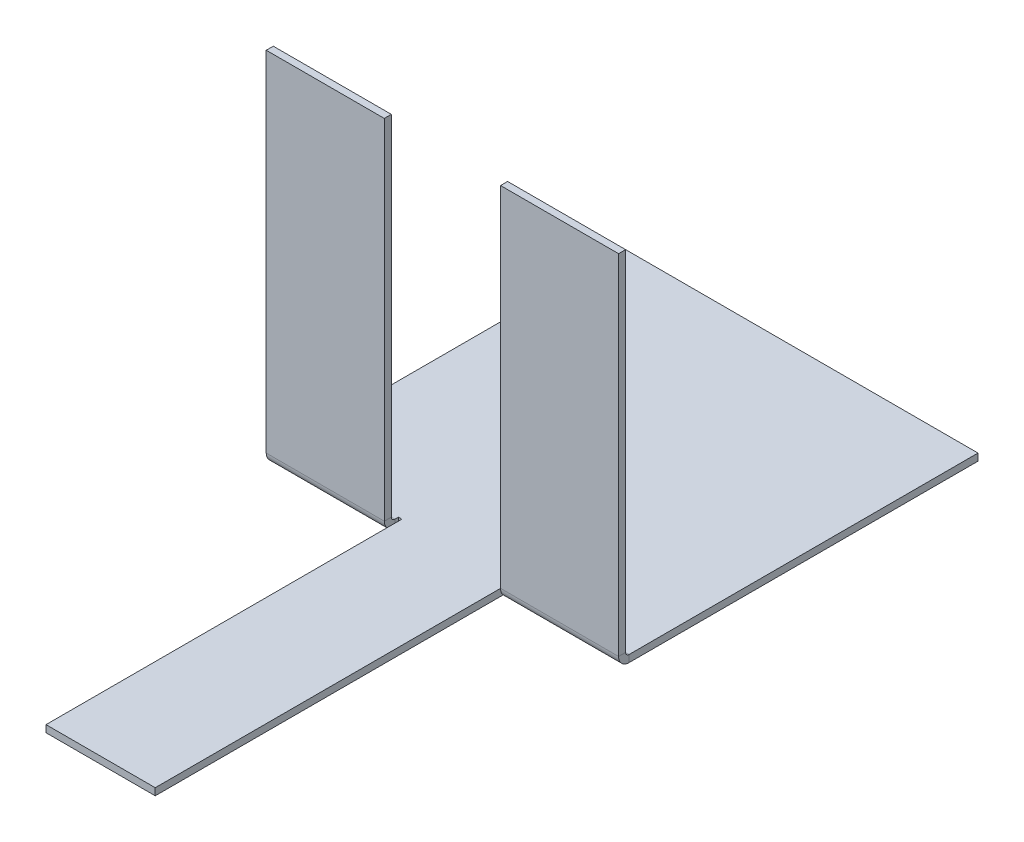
ISO-10303-21;
HEADER;
FILE_DESCRIPTION(('STEP AP214'),'2;1');
FILE_NAME('part.step','',(''),(''),'','','');
FILE_SCHEMA(('AUTOMOTIVE_DESIGN { 1 0 10303 214 1 1 1 1 }'));
ENDSEC;
DATA;
#1=APPLICATION_CONTEXT('core data for automotive mechanical design processes');
#2=APPLICATION_PROTOCOL_DEFINITION('international standard','automotive_design',2000,#1);
#3=PRODUCT_CONTEXT('',#1,'mechanical');
#4=PRODUCT('Part','Part','',(#3));
#5=PRODUCT_RELATED_PRODUCT_CATEGORY('part','',(#4));
#6=PRODUCT_DEFINITION_FORMATION('','',#4);
#7=PRODUCT_DEFINITION_CONTEXT('part definition',#1,'design');
#8=PRODUCT_DEFINITION('design','',#6,#7);
#9=PRODUCT_DEFINITION_SHAPE('','',#8);
#10=(LENGTH_UNIT() NAMED_UNIT(*) SI_UNIT(.MILLI.,.METRE.));
#11=(NAMED_UNIT(*) PLANE_ANGLE_UNIT() SI_UNIT($,.RADIAN.));
#12=(NAMED_UNIT(*) SI_UNIT($,.STERADIAN.) SOLID_ANGLE_UNIT());
#13=UNCERTAINTY_MEASURE_WITH_UNIT(LENGTH_MEASURE(1.E-05),#10,'distance_accuracy_value','');
#14=(GEOMETRIC_REPRESENTATION_CONTEXT(3) GLOBAL_UNCERTAINTY_ASSIGNED_CONTEXT((#13)) GLOBAL_UNIT_ASSIGNED_CONTEXT((#10,
#11,#12)) REPRESENTATION_CONTEXT('',''));
#15=CARTESIAN_POINT('',(0.,0.,0.));
#16=DIRECTION('',(0.,0.,1.));
#17=DIRECTION('',(1.,0.,0.));
#18=AXIS2_PLACEMENT_3D('',#15,#16,#17);
#19=CARTESIAN_POINT('',(0.,-2.,100.));
#20=DIRECTION('',(0.,1.,0.));
#21=DIRECTION('',(0.,0.,1.));
#22=AXIS2_PLACEMENT_3D('',#19,#20,#21);
#23=PLANE('',#22);
#24=DIRECTION('',(1.,0.,0.));
#25=VECTOR('',#24,1.);
#26=CARTESIAN_POINT('',(100.,-2.,99.));
#27=LINE('',#26,#25);
#28=CARTESIAN_POINT('',(100.,-2.,99.));
#29=VERTEX_POINT('',#28);
#30=CARTESIAN_POINT('',(66.5,-2.,99.));
#31=VERTEX_POINT('',#30);
#32=EDGE_CURVE('E227',#29,#31,#27,.F.);
#33=ORIENTED_EDGE('',*,*,#32,.T.);
#34=DIRECTION('',(0.,0.,1.));
#35=VECTOR('',#34,1.);
#36=CARTESIAN_POINT('',(66.5,-2.,100.));
#37=LINE('',#36,#35);
#38=CARTESIAN_POINT('',(66.5,-2.,98.));
#39=VERTEX_POINT('',#38);
#40=EDGE_CURVE('E176',#39,#31,#37,.T.);
#41=ORIENTED_EDGE('',*,*,#40,.F.);
#42=DIRECTION('',(1.,0.,0.));
#43=VECTOR('',#42,1.);
#44=CARTESIAN_POINT('',(0.,-2.,98.));
#45=LINE('',#44,#43);
#46=CARTESIAN_POINT('',(65.5,-2.,98.));
#47=VERTEX_POINT('',#46);
#48=EDGE_CURVE('E173',#47,#39,#45,.T.);
#49=ORIENTED_EDGE('',*,*,#48,.F.);
#50=DIRECTION('',(0.,0.,-1.));
#51=VECTOR('',#50,1.);
#52=CARTESIAN_POINT('',(65.5,-2.,100.));
#53=LINE('',#52,#51);
#54=CARTESIAN_POINT('',(65.5,-2.,199.));
#55=VERTEX_POINT('',#54);
#56=EDGE_CURVE('E167',#55,#47,#53,.T.);
#57=ORIENTED_EDGE('',*,*,#56,.F.);
#58=DIRECTION('',(1.,0.,0.));
#59=VECTOR('',#58,1.);
#60=CARTESIAN_POINT('',(34.5,-2.,199.));
#61=LINE('',#60,#59);
#62=CARTESIAN_POINT('',(34.5,-2.,199.));
#63=VERTEX_POINT('',#62);
#64=EDGE_CURVE('E171',#63,#55,#61,.T.);
#65=ORIENTED_EDGE('',*,*,#64,.F.);
#66=DIRECTION('',(0.,0.,1.));
#67=VECTOR('',#66,1.);
#68=CARTESIAN_POINT('',(34.5,-2.,100.));
#69=LINE('',#68,#67);
#70=CARTESIAN_POINT('',(34.5,-2.,98.));
#71=VERTEX_POINT('',#70);
#72=EDGE_CURVE('E49',#71,#63,#69,.T.);
#73=ORIENTED_EDGE('',*,*,#72,.F.);
#74=DIRECTION('',(1.,0.,0.));
#75=VECTOR('',#74,1.);
#76=CARTESIAN_POINT('',(0.,-2.,98.));
#77=LINE('',#76,#75);
#78=CARTESIAN_POINT('',(33.5,-2.,98.));
#79=VERTEX_POINT('',#78);
#80=EDGE_CURVE('E53',#79,#71,#77,.T.);
#81=ORIENTED_EDGE('',*,*,#80,.F.);
#82=DIRECTION('',(0.,0.,-1.));
#83=VECTOR('',#82,1.);
#84=CARTESIAN_POINT('',(33.5,-2.,100.));
#85=LINE('',#84,#83);
#86=CARTESIAN_POINT('',(33.5,-2.,99.));
#87=VERTEX_POINT('',#86);
#88=EDGE_CURVE('E319',#87,#79,#85,.T.);
#89=ORIENTED_EDGE('',*,*,#88,.F.);
#90=DIRECTION('',(1.,0.,0.));
#91=VECTOR('',#90,1.);
#92=CARTESIAN_POINT('',(33.5,-2.,99.));
#93=LINE('',#92,#91);
#94=CARTESIAN_POINT('',(0.,-2.,99.));
#95=VERTEX_POINT('',#94);
#96=EDGE_CURVE('E294',#87,#95,#93,.F.);
#97=ORIENTED_EDGE('',*,*,#96,.T.);
#98=DIRECTION('',(0.,0.,-1.));
#99=VECTOR('',#98,1.);
#100=CARTESIAN_POINT('',(0.,-2.,100.));
#101=LINE('',#100,#99);
#102=CARTESIAN_POINT('',(0.,-2.,0.));
#103=VERTEX_POINT('',#102);
#104=EDGE_CURVE('E346',#95,#103,#101,.T.);
#105=ORIENTED_EDGE('',*,*,#104,.T.);
#106=DIRECTION('',(1.,0.,0.));
#107=VECTOR('',#106,1.);
#108=CARTESIAN_POINT('',(0.,-2.,0.));
#109=LINE('',#108,#107);
#110=CARTESIAN_POINT('',(100.,-2.,0.));
#111=VERTEX_POINT('',#110);
#112=EDGE_CURVE('E334',#103,#111,#109,.T.);
#113=ORIENTED_EDGE('',*,*,#112,.T.);
#114=DIRECTION('',(0.,0.,-1.));
#115=VECTOR('',#114,1.);
#116=CARTESIAN_POINT('',(100.,-2.,100.));
#117=LINE('',#116,#115);
#118=EDGE_CURVE('E11',#29,#111,#117,.T.);
#119=ORIENTED_EDGE('',*,*,#118,.F.);
#120=EDGE_LOOP('',(#33,#41,#49,#57,#65,#73,#81,#89,#97,#105,#113,#119));
#121=FACE_BOUND('',#120,.T.);
#122=ADVANCED_FACE('F35',(#121),#23,.F.);
#123=CARTESIAN_POINT('',(0.,0.,100.));
#124=DIRECTION('',(0.,1.,0.));
#125=DIRECTION('',(0.,0.,1.));
#126=AXIS2_PLACEMENT_3D('',#123,#124,#125);
#127=PLANE('',#126);
#128=DIRECTION('',(0.,0.,-1.));
#129=VECTOR('',#128,1.);
#130=CARTESIAN_POINT('',(66.5,0.,99.));
#131=LINE('',#130,#129);
#132=CARTESIAN_POINT('',(66.5,0.,99.));
#133=VERTEX_POINT('',#132);
#134=CARTESIAN_POINT('',(66.5,0.,98.));
#135=VERTEX_POINT('',#134);
#136=EDGE_CURVE('E250',#133,#135,#131,.T.);
#137=ORIENTED_EDGE('',*,*,#136,.F.);
#138=DIRECTION('',(1.,0.,0.));
#139=VECTOR('',#138,1.);
#140=CARTESIAN_POINT('',(100.,0.,99.));
#141=LINE('',#140,#139);
#142=CARTESIAN_POINT('',(100.,0.,99.));
#143=VERTEX_POINT('',#142);
#144=EDGE_CURVE('E239',#143,#133,#141,.F.);
#145=ORIENTED_EDGE('',*,*,#144,.F.);
#146=DIRECTION('',(0.,0.,-1.));
#147=VECTOR('',#146,1.);
#148=CARTESIAN_POINT('',(100.,0.,100.));
#149=LINE('',#148,#147);
#150=CARTESIAN_POINT('',(100.,0.,0.));
#151=VERTEX_POINT('',#150);
#152=EDGE_CURVE('E42',#143,#151,#149,.T.);
#153=ORIENTED_EDGE('',*,*,#152,.T.);
#154=DIRECTION('',(1.,0.,0.));
#155=VECTOR('',#154,1.);
#156=CARTESIAN_POINT('',(0.,0.,0.));
#157=LINE('',#156,#155);
#158=CARTESIAN_POINT('',(0.,0.,0.));
#159=VERTEX_POINT('',#158);
#160=EDGE_CURVE('E340',#159,#151,#157,.T.);
#161=ORIENTED_EDGE('',*,*,#160,.F.);
#162=DIRECTION('',(0.,0.,-1.));
#163=VECTOR('',#162,1.);
#164=CARTESIAN_POINT('',(0.,0.,100.));
#165=LINE('',#164,#163);
#166=CARTESIAN_POINT('',(0.,0.,99.));
#167=VERTEX_POINT('',#166);
#168=EDGE_CURVE('E348',#167,#159,#165,.T.);
#169=ORIENTED_EDGE('',*,*,#168,.F.);
#170=DIRECTION('',(1.,0.,0.));
#171=VECTOR('',#170,1.);
#172=CARTESIAN_POINT('',(33.5,0.,99.));
#173=LINE('',#172,#171);
#174=CARTESIAN_POINT('',(33.5,0.,99.));
#175=VERTEX_POINT('',#174);
#176=EDGE_CURVE('E306',#175,#167,#173,.F.);
#177=ORIENTED_EDGE('',*,*,#176,.F.);
#178=DIRECTION('',(0.,0.,1.));
#179=VECTOR('',#178,1.);
#180=CARTESIAN_POINT('',(33.5,0.,98.));
#181=LINE('',#180,#179);
#182=CARTESIAN_POINT('',(33.5,0.,98.));
#183=VERTEX_POINT('',#182);
#184=EDGE_CURVE('E324',#183,#175,#181,.T.);
#185=ORIENTED_EDGE('',*,*,#184,.F.);
#186=DIRECTION('',(-1.,0.,0.));
#187=VECTOR('',#186,1.);
#188=CARTESIAN_POINT('',(34.5,0.,98.));
#189=LINE('',#188,#187);
#190=CARTESIAN_POINT('',(34.5,0.,98.));
#191=VERTEX_POINT('',#190);
#192=EDGE_CURVE('E320',#191,#183,#189,.T.);
#193=ORIENTED_EDGE('',*,*,#192,.F.);
#194=DIRECTION('',(0.,0.,-1.));
#195=VECTOR('',#194,1.);
#196=CARTESIAN_POINT('',(34.5,0.,100.));
#197=LINE('',#196,#195);
#198=CARTESIAN_POINT('',(34.5,0.,199.));
#199=VERTEX_POINT('',#198);
#200=EDGE_CURVE('E316',#199,#191,#197,.T.);
#201=ORIENTED_EDGE('',*,*,#200,.F.);
#202=DIRECTION('',(-1.,0.,0.));
#203=VECTOR('',#202,1.);
#204=CARTESIAN_POINT('',(65.5,0.,199.));
#205=LINE('',#204,#203);
#206=CARTESIAN_POINT('',(65.5,0.,199.));
#207=VERTEX_POINT('',#206);
#208=EDGE_CURVE('E186',#207,#199,#205,.T.);
#209=ORIENTED_EDGE('',*,*,#208,.F.);
#210=DIRECTION('',(0.,0.,1.));
#211=VECTOR('',#210,1.);
#212=CARTESIAN_POINT('',(65.5,0.,98.));
#213=LINE('',#212,#211);
#214=CARTESIAN_POINT('',(65.5,0.,98.));
#215=VERTEX_POINT('',#214);
#216=EDGE_CURVE('E182',#215,#207,#213,.T.);
#217=ORIENTED_EDGE('',*,*,#216,.F.);
#218=DIRECTION('',(-1.,0.,0.));
#219=VECTOR('',#218,1.);
#220=CARTESIAN_POINT('',(66.5,0.,98.));
#221=LINE('',#220,#219);
#222=EDGE_CURVE('E253',#135,#215,#221,.T.);
#223=ORIENTED_EDGE('',*,*,#222,.F.);
#224=EDGE_LOOP('',(#137,#145,#153,#161,#169,#177,#185,#193,#201,#209,#217,#223));
#225=FACE_BOUND('',#224,.T.);
#226=ADVANCED_FACE('F354',(#225),#127,.T.);
#227=CARTESIAN_POINT('',(100.,0.,100.));
#228=DIRECTION('',(1.,0.,0.));
#229=DIRECTION('',(0.,0.,-1.));
#230=AXIS2_PLACEMENT_3D('',#227,#228,#229);
#231=PLANE('',#230);
#232=ORIENTED_EDGE('',*,*,#152,.F.);
#233=DIRECTION('',(0.,-1.,0.));
#234=VECTOR('',#233,1.);
#235=CARTESIAN_POINT('',(100.,0.,99.));
#236=LINE('',#235,#234);
#237=EDGE_CURVE('E233',#143,#29,#236,.T.);
#238=ORIENTED_EDGE('',*,*,#237,.T.);
#239=ORIENTED_EDGE('',*,*,#118,.T.);
#240=DIRECTION('',(0.,-1.,0.));
#241=VECTOR('',#240,1.);
#242=CARTESIAN_POINT('',(100.,0.,0.));
#243=LINE('',#242,#241);
#244=EDGE_CURVE('E337',#151,#111,#243,.T.);
#245=ORIENTED_EDGE('',*,*,#244,.F.);
#246=EDGE_LOOP('',(#232,#238,#239,#245));
#247=FACE_BOUND('',#246,.T.);
#248=ADVANCED_FACE('F358',(#247),#231,.T.);
#249=CARTESIAN_POINT('',(0.,-2.,100.));
#250=DIRECTION('',(-1.,0.,0.));
#251=DIRECTION('',(0.,0.,1.));
#252=AXIS2_PLACEMENT_3D('',#249,#250,#251);
#253=PLANE('',#252);
#254=DIRECTION('',(0.,-1.,0.));
#255=VECTOR('',#254,1.);
#256=CARTESIAN_POINT('',(0.,0.,99.));
#257=LINE('',#256,#255);
#258=EDGE_CURVE('E311',#167,#95,#257,.T.);
#259=ORIENTED_EDGE('',*,*,#258,.F.);
#260=ORIENTED_EDGE('',*,*,#168,.T.);
#261=DIRECTION('',(0.,1.,0.));
#262=VECTOR('',#261,1.);
#263=CARTESIAN_POINT('',(0.,-2.,0.));
#264=LINE('',#263,#262);
#265=EDGE_CURVE('E343',#103,#159,#264,.T.);
#266=ORIENTED_EDGE('',*,*,#265,.F.);
#267=ORIENTED_EDGE('',*,*,#104,.F.);
#268=EDGE_LOOP('',(#259,#260,#266,#267));
#269=FACE_BOUND('',#268,.T.);
#270=ADVANCED_FACE('F365',(#269),#253,.T.);
#271=CARTESIAN_POINT('',(100.,-2.,0.));
#272=DIRECTION('',(0.,0.,-1.));
#273=DIRECTION('',(-1.,0.,0.));
#274=AXIS2_PLACEMENT_3D('',#271,#272,#273);
#275=PLANE('',#274);
#276=ORIENTED_EDGE('',*,*,#112,.F.);
#277=ORIENTED_EDGE('',*,*,#265,.T.);
#278=ORIENTED_EDGE('',*,*,#160,.T.);
#279=ORIENTED_EDGE('',*,*,#244,.T.);
#280=EDGE_LOOP('',(#276,#277,#278,#279));
#281=FACE_BOUND('',#280,.T.);
#282=ADVANCED_FACE('F361',(#281),#275,.T.);
#283=CARTESIAN_POINT('',(34.5,0.,98.));
#284=DIRECTION('',(0.,0.,1.));
#285=DIRECTION('',(0.,-1.,0.));
#286=AXIS2_PLACEMENT_3D('',#283,#284,#285);
#287=PLANE('',#286);
#288=DIRECTION('',(0.,-1.,0.));
#289=VECTOR('',#288,1.);
#290=CARTESIAN_POINT('',(33.5,0.,98.));
#291=LINE('',#290,#289);
#292=EDGE_CURVE('E314',#183,#79,#291,.T.);
#293=ORIENTED_EDGE('',*,*,#292,.T.);
#294=ORIENTED_EDGE('',*,*,#80,.T.);
#295=DIRECTION('',(0.,-1.,0.));
#296=VECTOR('',#295,1.);
#297=CARTESIAN_POINT('',(34.5,0.,98.));
#298=LINE('',#297,#296);
#299=EDGE_CURVE('E323',#191,#71,#298,.T.);
#300=ORIENTED_EDGE('',*,*,#299,.F.);
#301=ORIENTED_EDGE('',*,*,#192,.T.);
#302=EDGE_LOOP('',(#293,#294,#300,#301));
#303=FACE_BOUND('',#302,.T.);
#304=ADVANCED_FACE('F421',(#303),#287,.T.);
#305=CARTESIAN_POINT('',(34.5,0.,100.));
#306=DIRECTION('',(-1.,0.,0.));
#307=DIRECTION('',(0.,0.,1.));
#308=AXIS2_PLACEMENT_3D('',#305,#306,#307);
#309=PLANE('',#308);
#310=ORIENTED_EDGE('',*,*,#299,.T.);
#311=ORIENTED_EDGE('',*,*,#72,.T.);
#312=DIRECTION('',(0.,-1.,0.));
#313=VECTOR('',#312,1.);
#314=CARTESIAN_POINT('',(34.5,0.,199.));
#315=LINE('',#314,#313);
#316=EDGE_CURVE('E191',#199,#63,#315,.T.);
#317=ORIENTED_EDGE('',*,*,#316,.F.);
#318=ORIENTED_EDGE('',*,*,#200,.T.);
#319=EDGE_LOOP('',(#310,#311,#317,#318));
#320=FACE_BOUND('',#319,.T.);
#321=ADVANCED_FACE('F422',(#320),#309,.T.);
#322=CARTESIAN_POINT('',(33.5,0.,98.));
#323=DIRECTION('',(1.,0.,0.));
#324=DIRECTION('',(0.,0.,-1.));
#325=AXIS2_PLACEMENT_3D('',#322,#323,#324);
#326=PLANE('',#325);
#327=DIRECTION('',(0.,-1.,0.));
#328=VECTOR('',#327,1.);
#329=CARTESIAN_POINT('',(33.5,0.,99.));
#330=LINE('',#329,#328);
#331=EDGE_CURVE('E300',#175,#87,#330,.T.);
#332=ORIENTED_EDGE('',*,*,#331,.T.);
#333=ORIENTED_EDGE('',*,*,#88,.T.);
#334=ORIENTED_EDGE('',*,*,#292,.F.);
#335=ORIENTED_EDGE('',*,*,#184,.T.);
#336=EDGE_LOOP('',(#332,#333,#334,#335));
#337=FACE_BOUND('',#336,.T.);
#338=ADVANCED_FACE('F425',(#337),#326,.T.);
#339=CARTESIAN_POINT('',(0.,1.,99.));
#340=DIRECTION('',(-1.,0.,0.));
#341=DIRECTION('',(0.,0.,1.));
#342=AXIS2_PLACEMENT_3D('',#339,#340,#341);
#343=PLANE('',#342);
#344=DIRECTION('',(0.,0.,1.));
#345=VECTOR('',#344,1.);
#346=CARTESIAN_POINT('',(0.,1.,100.));
#347=LINE('',#346,#345);
#348=CARTESIAN_POINT('',(0.,1.,100.));
#349=VERTEX_POINT('',#348);
#350=CARTESIAN_POINT('',(0.,1.,102.));
#351=VERTEX_POINT('',#350);
#352=EDGE_CURVE('E263',#349,#351,#347,.T.);
#353=ORIENTED_EDGE('',*,*,#352,.F.);
#354=CARTESIAN_POINT('',(0.,1.,99.));
#355=DIRECTION('',(1.,0.,0.));
#356=DIRECTION('',(0.,0.,-1.));
#357=AXIS2_PLACEMENT_3D('',#354,#355,#356);
#358=CIRCLE('',#357,1.);
#359=EDGE_CURVE('E303',#167,#349,#358,.F.);
#360=ORIENTED_EDGE('',*,*,#359,.F.);
#361=ORIENTED_EDGE('',*,*,#258,.T.);
#362=CARTESIAN_POINT('',(0.,1.,99.));
#363=DIRECTION('',(1.,0.,0.));
#364=DIRECTION('',(0.,0.,-1.));
#365=AXIS2_PLACEMENT_3D('',#362,#363,#364);
#366=CIRCLE('',#365,3.);
#367=EDGE_CURVE('E296',#95,#351,#366,.F.);
#368=ORIENTED_EDGE('',*,*,#367,.T.);
#369=EDGE_LOOP('',(#353,#360,#361,#368));
#370=FACE_BOUND('',#369,.T.);
#371=ADVANCED_FACE('F372',(#370),#343,.T.);
#372=CARTESIAN_POINT('',(33.5,1.,99.));
#373=DIRECTION('',(-1.,0.,0.));
#374=DIRECTION('',(0.,0.,1.));
#375=AXIS2_PLACEMENT_3D('',#372,#373,#374);
#376=PLANE('',#375);
#377=CARTESIAN_POINT('',(33.5,1.,99.));
#378=DIRECTION('',(1.,0.,0.));
#379=DIRECTION('',(0.,0.,-1.));
#380=AXIS2_PLACEMENT_3D('',#377,#378,#379);
#381=CIRCLE('',#380,1.);
#382=CARTESIAN_POINT('',(33.5,1.,100.));
#383=VERTEX_POINT('',#382);
#384=EDGE_CURVE('E293',#383,#175,#381,.T.);
#385=ORIENTED_EDGE('',*,*,#384,.F.);
#386=DIRECTION('',(0.,0.,1.));
#387=VECTOR('',#386,1.);
#388=CARTESIAN_POINT('',(33.5,1.,100.));
#389=LINE('',#388,#387);
#390=CARTESIAN_POINT('',(33.5,1.,102.));
#391=VERTEX_POINT('',#390);
#392=EDGE_CURVE('E266',#383,#391,#389,.T.);
#393=ORIENTED_EDGE('',*,*,#392,.T.);
#394=CARTESIAN_POINT('',(33.5,1.,99.));
#395=DIRECTION('',(1.,0.,0.));
#396=DIRECTION('',(0.,0.,-1.));
#397=AXIS2_PLACEMENT_3D('',#394,#395,#396);
#398=CIRCLE('',#397,3.);
#399=EDGE_CURVE('E297',#391,#87,#398,.T.);
#400=ORIENTED_EDGE('',*,*,#399,.T.);
#401=ORIENTED_EDGE('',*,*,#331,.F.);
#402=EDGE_LOOP('',(#385,#393,#400,#401));
#403=FACE_BOUND('',#402,.T.);
#404=ADVANCED_FACE('F394',(#403),#376,.F.);
#405=CARTESIAN_POINT('',(33.5,1.,99.));
#406=DIRECTION('',(1.,0.,0.));
#407=DIRECTION('',(0.,0.,1.));
#408=AXIS2_PLACEMENT_3D('',#405,#406,#407);
#409=CYLINDRICAL_SURFACE('',#408,3.);
#410=ORIENTED_EDGE('',*,*,#96,.F.);
#411=ORIENTED_EDGE('',*,*,#399,.F.);
#412=DIRECTION('',(-1.,0.,0.));
#413=VECTOR('',#412,1.);
#414=CARTESIAN_POINT('',(33.5,1.,102.));
#415=LINE('',#414,#413);
#416=EDGE_CURVE('E269',#391,#351,#415,.T.);
#417=ORIENTED_EDGE('',*,*,#416,.T.);
#418=ORIENTED_EDGE('',*,*,#367,.F.);
#419=EDGE_LOOP('',(#410,#411,#417,#418));
#420=FACE_BOUND('',#419,.T.);
#421=ADVANCED_FACE('F404',(#420),#409,.T.);
#422=CARTESIAN_POINT('',(33.5,1.,99.));
#423=DIRECTION('',(1.,0.,0.));
#424=DIRECTION('',(0.,0.,1.));
#425=AXIS2_PLACEMENT_3D('',#422,#423,#424);
#426=CYLINDRICAL_SURFACE('',#425,1.);
#427=ORIENTED_EDGE('',*,*,#176,.T.);
#428=ORIENTED_EDGE('',*,*,#359,.T.);
#429=DIRECTION('',(1.,0.,0.));
#430=VECTOR('',#429,1.);
#431=CARTESIAN_POINT('',(0.,1.,100.));
#432=LINE('',#431,#430);
#433=EDGE_CURVE('E264',#349,#383,#432,.T.);
#434=ORIENTED_EDGE('',*,*,#433,.T.);
#435=ORIENTED_EDGE('',*,*,#384,.T.);
#436=EDGE_LOOP('',(#427,#428,#434,#435));
#437=FACE_BOUND('',#436,.T.);
#438=ADVANCED_FACE('F368',(#437),#426,.F.);
#439=CARTESIAN_POINT('',(33.5,100.,102.));
#440=DIRECTION('',(-1.,0.,0.));
#441=DIRECTION('',(0.,0.,1.));
#442=AXIS2_PLACEMENT_3D('',#439,#440,#441);
#443=PLANE('',#442);
#444=ORIENTED_EDGE('',*,*,#392,.F.);
#445=DIRECTION('',(0.,1.,0.));
#446=VECTOR('',#445,1.);
#447=CARTESIAN_POINT('',(33.5,100.,100.));
#448=LINE('',#447,#446);
#449=CARTESIAN_POINT('',(33.5,100.,100.));
#450=VERTEX_POINT('',#449);
#451=EDGE_CURVE('E273',#383,#450,#448,.T.);
#452=ORIENTED_EDGE('',*,*,#451,.T.);
#453=DIRECTION('',(0.,0.,-1.));
#454=VECTOR('',#453,1.);
#455=CARTESIAN_POINT('',(33.5,100.,102.));
#456=LINE('',#455,#454);
#457=CARTESIAN_POINT('',(33.5,100.,102.));
#458=VERTEX_POINT('',#457);
#459=EDGE_CURVE('E290',#458,#450,#456,.T.);
#460=ORIENTED_EDGE('',*,*,#459,.F.);
#461=DIRECTION('',(0.,1.,0.));
#462=VECTOR('',#461,1.);
#463=CARTESIAN_POINT('',(33.5,100.,102.));
#464=LINE('',#463,#462);
#465=EDGE_CURVE('E274',#391,#458,#464,.T.);
#466=ORIENTED_EDGE('',*,*,#465,.F.);
#467=EDGE_LOOP('',(#444,#452,#460,#466));
#468=FACE_BOUND('',#467,.T.);
#469=ADVANCED_FACE('F396',(#468),#443,.F.);
#470=CARTESIAN_POINT('',(0.,0.,102.));
#471=DIRECTION('',(1.,0.,0.));
#472=DIRECTION('',(0.,0.,-1.));
#473=AXIS2_PLACEMENT_3D('',#470,#471,#472);
#474=PLANE('',#473);
#475=ORIENTED_EDGE('',*,*,#352,.T.);
#476=DIRECTION('',(0.,-1.,0.));
#477=VECTOR('',#476,1.);
#478=CARTESIAN_POINT('',(0.,0.,102.));
#479=LINE('',#478,#477);
#480=CARTESIAN_POINT('',(0.,100.,102.));
#481=VERTEX_POINT('',#480);
#482=EDGE_CURVE('E279',#481,#351,#479,.T.);
#483=ORIENTED_EDGE('',*,*,#482,.F.);
#484=DIRECTION('',(0.,0.,-1.));
#485=VECTOR('',#484,1.);
#486=CARTESIAN_POINT('',(0.,100.,102.));
#487=LINE('',#486,#485);
#488=CARTESIAN_POINT('',(0.,100.,100.));
#489=VERTEX_POINT('',#488);
#490=EDGE_CURVE('E282',#481,#489,#487,.T.);
#491=ORIENTED_EDGE('',*,*,#490,.T.);
#492=DIRECTION('',(0.,-1.,0.));
#493=VECTOR('',#492,1.);
#494=CARTESIAN_POINT('',(0.,0.,100.));
#495=LINE('',#494,#493);
#496=EDGE_CURVE('E277',#489,#349,#495,.T.);
#497=ORIENTED_EDGE('',*,*,#496,.T.);
#498=EDGE_LOOP('',(#475,#483,#491,#497));
#499=FACE_BOUND('',#498,.T.);
#500=ADVANCED_FACE('F376',(#499),#474,.F.);
#501=CARTESIAN_POINT('',(33.5,0.,102.));
#502=DIRECTION('',(0.,0.,-1.));
#503=DIRECTION('',(-1.,0.,0.));
#504=AXIS2_PLACEMENT_3D('',#501,#502,#503);
#505=PLANE('',#504);
#506=ORIENTED_EDGE('',*,*,#416,.F.);
#507=ORIENTED_EDGE('',*,*,#465,.T.);
#508=DIRECTION('',(-1.,0.,0.));
#509=VECTOR('',#508,1.);
#510=CARTESIAN_POINT('',(0.,100.,102.));
#511=LINE('',#510,#509);
#512=EDGE_CURVE('E276',#458,#481,#511,.T.);
#513=ORIENTED_EDGE('',*,*,#512,.T.);
#514=ORIENTED_EDGE('',*,*,#482,.T.);
#515=EDGE_LOOP('',(#506,#507,#513,#514));
#516=FACE_BOUND('',#515,.T.);
#517=ADVANCED_FACE('F380',(#516),#505,.F.);
#518=CARTESIAN_POINT('',(33.5,0.,100.));
#519=DIRECTION('',(0.,0.,-1.));
#520=DIRECTION('',(-1.,0.,0.));
#521=AXIS2_PLACEMENT_3D('',#518,#519,#520);
#522=PLANE('',#521);
#523=ORIENTED_EDGE('',*,*,#451,.F.);
#524=ORIENTED_EDGE('',*,*,#433,.F.);
#525=ORIENTED_EDGE('',*,*,#496,.F.);
#526=DIRECTION('',(-1.,0.,0.));
#527=VECTOR('',#526,1.);
#528=CARTESIAN_POINT('',(0.,100.,100.));
#529=LINE('',#528,#527);
#530=EDGE_CURVE('E284',#450,#489,#529,.T.);
#531=ORIENTED_EDGE('',*,*,#530,.F.);
#532=EDGE_LOOP('',(#523,#524,#525,#531));
#533=FACE_BOUND('',#532,.T.);
#534=ADVANCED_FACE('F390',(#533),#522,.T.);
#535=CARTESIAN_POINT('',(0.,100.,102.));
#536=DIRECTION('',(0.,-1.,0.));
#537=DIRECTION('',(0.,0.,-1.));
#538=AXIS2_PLACEMENT_3D('',#535,#536,#537);
#539=PLANE('',#538);
#540=ORIENTED_EDGE('',*,*,#530,.T.);
#541=ORIENTED_EDGE('',*,*,#490,.F.);
#542=ORIENTED_EDGE('',*,*,#512,.F.);
#543=ORIENTED_EDGE('',*,*,#459,.T.);
#544=EDGE_LOOP('',(#540,#541,#542,#543));
#545=FACE_BOUND('',#544,.T.);
#546=ADVANCED_FACE('F386',(#545),#539,.F.);
#547=CARTESIAN_POINT('',(66.5,0.,98.));
#548=DIRECTION('',(0.,0.,1.));
#549=DIRECTION('',(0.,-1.,0.));
#550=AXIS2_PLACEMENT_3D('',#547,#548,#549);
#551=PLANE('',#550);
#552=DIRECTION('',(0.,-1.,0.));
#553=VECTOR('',#552,1.);
#554=CARTESIAN_POINT('',(65.5,0.,98.));
#555=LINE('',#554,#553);
#556=EDGE_CURVE('E247',#215,#47,#555,.T.);
#557=ORIENTED_EDGE('',*,*,#556,.T.);
#558=ORIENTED_EDGE('',*,*,#48,.T.);
#559=DIRECTION('',(0.,-1.,0.));
#560=VECTOR('',#559,1.);
#561=CARTESIAN_POINT('',(66.5,0.,98.));
#562=LINE('',#561,#560);
#563=EDGE_CURVE('E256',#135,#39,#562,.T.);
#564=ORIENTED_EDGE('',*,*,#563,.F.);
#565=ORIENTED_EDGE('',*,*,#222,.T.);
#566=EDGE_LOOP('',(#557,#558,#564,#565));
#567=FACE_BOUND('',#566,.T.);
#568=ADVANCED_FACE('F445',(#567),#551,.T.);
#569=CARTESIAN_POINT('',(65.5,0.,98.));
#570=DIRECTION('',(1.,0.,0.));
#571=DIRECTION('',(0.,0.,-1.));
#572=AXIS2_PLACEMENT_3D('',#569,#570,#571);
#573=PLANE('',#572);
#574=ORIENTED_EDGE('',*,*,#216,.T.);
#575=DIRECTION('',(0.,1.,0.));
#576=VECTOR('',#575,1.);
#577=CARTESIAN_POINT('',(65.5,-2.,199.));
#578=LINE('',#577,#576);
#579=EDGE_CURVE('E179',#55,#207,#578,.T.);
#580=ORIENTED_EDGE('',*,*,#579,.F.);
#581=ORIENTED_EDGE('',*,*,#56,.T.);
#582=ORIENTED_EDGE('',*,*,#556,.F.);
#583=EDGE_LOOP('',(#574,#580,#581,#582));
#584=FACE_BOUND('',#583,.T.);
#585=ADVANCED_FACE('F180',(#584),#573,.T.);
#586=CARTESIAN_POINT('',(66.5,0.,99.));
#587=DIRECTION('',(-1.,0.,0.));
#588=DIRECTION('',(0.,0.,1.));
#589=AXIS2_PLACEMENT_3D('',#586,#587,#588);
#590=PLANE('',#589);
#591=ORIENTED_EDGE('',*,*,#563,.T.);
#592=ORIENTED_EDGE('',*,*,#40,.T.);
#593=DIRECTION('',(0.,-1.,0.));
#594=VECTOR('',#593,1.);
#595=CARTESIAN_POINT('',(66.5,0.,99.));
#596=LINE('',#595,#594);
#597=EDGE_CURVE('E244',#133,#31,#596,.T.);
#598=ORIENTED_EDGE('',*,*,#597,.F.);
#599=ORIENTED_EDGE('',*,*,#136,.T.);
#600=EDGE_LOOP('',(#591,#592,#598,#599));
#601=FACE_BOUND('',#600,.T.);
#602=ADVANCED_FACE('F447',(#601),#590,.T.);
#603=CARTESIAN_POINT('',(66.5,1.,99.));
#604=DIRECTION('',(-1.,0.,0.));
#605=DIRECTION('',(0.,0.,1.));
#606=AXIS2_PLACEMENT_3D('',#603,#604,#605);
#607=PLANE('',#606);
#608=DIRECTION('',(0.,0.,1.));
#609=VECTOR('',#608,1.);
#610=CARTESIAN_POINT('',(66.5,1.,100.));
#611=LINE('',#610,#609);
#612=CARTESIAN_POINT('',(66.5,1.,100.));
#613=VERTEX_POINT('',#612);
#614=CARTESIAN_POINT('',(66.5,1.,102.));
#615=VERTEX_POINT('',#614);
#616=EDGE_CURVE('E196',#613,#615,#611,.T.);
#617=ORIENTED_EDGE('',*,*,#616,.F.);
#618=CARTESIAN_POINT('',(66.5,1.,99.));
#619=DIRECTION('',(1.,0.,0.));
#620=DIRECTION('',(0.,0.,-1.));
#621=AXIS2_PLACEMENT_3D('',#618,#619,#620);
#622=CIRCLE('',#621,1.);
#623=EDGE_CURVE('E236',#133,#613,#622,.F.);
#624=ORIENTED_EDGE('',*,*,#623,.F.);
#625=ORIENTED_EDGE('',*,*,#597,.T.);
#626=CARTESIAN_POINT('',(66.5,1.,99.));
#627=DIRECTION('',(1.,0.,0.));
#628=DIRECTION('',(0.,0.,-1.));
#629=AXIS2_PLACEMENT_3D('',#626,#627,#628);
#630=CIRCLE('',#629,3.);
#631=EDGE_CURVE('E229',#31,#615,#630,.F.);
#632=ORIENTED_EDGE('',*,*,#631,.T.);
#633=EDGE_LOOP('',(#617,#624,#625,#632));
#634=FACE_BOUND('',#633,.T.);
#635=ADVANCED_FACE('F451',(#634),#607,.T.);
#636=CARTESIAN_POINT('',(100.,1.,99.));
#637=DIRECTION('',(-1.,0.,0.));
#638=DIRECTION('',(0.,0.,1.));
#639=AXIS2_PLACEMENT_3D('',#636,#637,#638);
#640=PLANE('',#639);
#641=CARTESIAN_POINT('',(100.,1.,99.));
#642=DIRECTION('',(1.,0.,0.));
#643=DIRECTION('',(0.,0.,-1.));
#644=AXIS2_PLACEMENT_3D('',#641,#642,#643);
#645=CIRCLE('',#644,1.);
#646=CARTESIAN_POINT('',(100.,1.,100.));
#647=VERTEX_POINT('',#646);
#648=EDGE_CURVE('E226',#647,#143,#645,.T.);
#649=ORIENTED_EDGE('',*,*,#648,.F.);
#650=DIRECTION('',(0.,0.,1.));
#651=VECTOR('',#650,1.);
#652=CARTESIAN_POINT('',(100.,1.,100.));
#653=LINE('',#652,#651);
#654=CARTESIAN_POINT('',(100.,1.,102.));
#655=VERTEX_POINT('',#654);
#656=EDGE_CURVE('E199',#647,#655,#653,.T.);
#657=ORIENTED_EDGE('',*,*,#656,.T.);
#658=CARTESIAN_POINT('',(100.,1.,99.));
#659=DIRECTION('',(1.,0.,0.));
#660=DIRECTION('',(0.,0.,-1.));
#661=AXIS2_PLACEMENT_3D('',#658,#659,#660);
#662=CIRCLE('',#661,3.);
#663=EDGE_CURVE('E230',#655,#29,#662,.T.);
#664=ORIENTED_EDGE('',*,*,#663,.T.);
#665=ORIENTED_EDGE('',*,*,#237,.F.);
#666=EDGE_LOOP('',(#649,#657,#664,#665));
#667=FACE_BOUND('',#666,.T.);
#668=ADVANCED_FACE('F495',(#667),#640,.F.);
#669=CARTESIAN_POINT('',(100.,1.,99.));
#670=DIRECTION('',(1.,0.,0.));
#671=DIRECTION('',(0.,0.,1.));
#672=AXIS2_PLACEMENT_3D('',#669,#670,#671);
#673=CYLINDRICAL_SURFACE('',#672,3.);
#674=ORIENTED_EDGE('',*,*,#32,.F.);
#675=ORIENTED_EDGE('',*,*,#663,.F.);
#676=DIRECTION('',(-1.,0.,0.));
#677=VECTOR('',#676,1.);
#678=CARTESIAN_POINT('',(66.5,1.,102.));
#679=LINE('',#678,#677);
#680=EDGE_CURVE('E202',#655,#615,#679,.T.);
#681=ORIENTED_EDGE('',*,*,#680,.T.);
#682=ORIENTED_EDGE('',*,*,#631,.F.);
#683=EDGE_LOOP('',(#674,#675,#681,#682));
#684=FACE_BOUND('',#683,.T.);
#685=ADVANCED_FACE('F454',(#684),#673,.T.);
#686=CARTESIAN_POINT('',(100.,1.,99.));
#687=DIRECTION('',(1.,0.,0.));
#688=DIRECTION('',(0.,0.,1.));
#689=AXIS2_PLACEMENT_3D('',#686,#687,#688);
#690=CYLINDRICAL_SURFACE('',#689,1.);
#691=ORIENTED_EDGE('',*,*,#144,.T.);
#692=ORIENTED_EDGE('',*,*,#623,.T.);
#693=DIRECTION('',(1.,0.,0.));
#694=VECTOR('',#693,1.);
#695=CARTESIAN_POINT('',(66.5,1.,100.));
#696=LINE('',#695,#694);
#697=EDGE_CURVE('E197',#613,#647,#696,.T.);
#698=ORIENTED_EDGE('',*,*,#697,.T.);
#699=ORIENTED_EDGE('',*,*,#648,.T.);
#700=EDGE_LOOP('',(#691,#692,#698,#699));
#701=FACE_BOUND('',#700,.T.);
#702=ADVANCED_FACE('F475',(#701),#690,.F.);
#703=CARTESIAN_POINT('',(66.5,0.,102.));
#704=DIRECTION('',(1.,0.,0.));
#705=DIRECTION('',(0.,0.,-1.));
#706=AXIS2_PLACEMENT_3D('',#703,#704,#705);
#707=PLANE('',#706);
#708=ORIENTED_EDGE('',*,*,#616,.T.);
#709=DIRECTION('',(0.,-1.,0.));
#710=VECTOR('',#709,1.);
#711=CARTESIAN_POINT('',(66.5,0.,102.));
#712=LINE('',#711,#710);
#713=CARTESIAN_POINT('',(66.5,100.,102.));
#714=VERTEX_POINT('',#713);
#715=EDGE_CURVE('E207',#714,#615,#712,.T.);
#716=ORIENTED_EDGE('',*,*,#715,.F.);
#717=DIRECTION('',(0.,0.,-1.));
#718=VECTOR('',#717,1.);
#719=CARTESIAN_POINT('',(66.5,100.,102.));
#720=LINE('',#719,#718);
#721=CARTESIAN_POINT('',(66.5,100.,100.));
#722=VERTEX_POINT('',#721);
#723=EDGE_CURVE('E215',#714,#722,#720,.T.);
#724=ORIENTED_EDGE('',*,*,#723,.T.);
#725=DIRECTION('',(0.,-1.,0.));
#726=VECTOR('',#725,1.);
#727=CARTESIAN_POINT('',(66.5,0.,100.));
#728=LINE('',#727,#726);
#729=EDGE_CURVE('E206',#722,#613,#728,.T.);
#730=ORIENTED_EDGE('',*,*,#729,.T.);
#731=EDGE_LOOP('',(#708,#716,#724,#730));
#732=FACE_BOUND('',#731,.T.);
#733=ADVANCED_FACE('F472',(#732),#707,.F.);
#734=CARTESIAN_POINT('',(100.,100.,102.));
#735=DIRECTION('',(-1.,0.,0.));
#736=DIRECTION('',(0.,0.,1.));
#737=AXIS2_PLACEMENT_3D('',#734,#735,#736);
#738=PLANE('',#737);
#739=ORIENTED_EDGE('',*,*,#656,.F.);
#740=DIRECTION('',(0.,1.,0.));
#741=VECTOR('',#740,1.);
#742=CARTESIAN_POINT('',(100.,100.,100.));
#743=LINE('',#742,#741);
#744=CARTESIAN_POINT('',(100.,100.,100.));
#745=VERTEX_POINT('',#744);
#746=EDGE_CURVE('E218',#647,#745,#743,.T.);
#747=ORIENTED_EDGE('',*,*,#746,.T.);
#748=DIRECTION('',(0.,0.,-1.));
#749=VECTOR('',#748,1.);
#750=CARTESIAN_POINT('',(100.,100.,102.));
#751=LINE('',#750,#749);
#752=CARTESIAN_POINT('',(100.,100.,102.));
#753=VERTEX_POINT('',#752);
#754=EDGE_CURVE('E223',#753,#745,#751,.T.);
#755=ORIENTED_EDGE('',*,*,#754,.F.);
#756=DIRECTION('',(0.,1.,0.));
#757=VECTOR('',#756,1.);
#758=CARTESIAN_POINT('',(100.,100.,102.));
#759=LINE('',#758,#757);
#760=EDGE_CURVE('E210',#655,#753,#759,.T.);
#761=ORIENTED_EDGE('',*,*,#760,.F.);
#762=EDGE_LOOP('',(#739,#747,#755,#761));
#763=FACE_BOUND('',#762,.T.);
#764=ADVANCED_FACE('F463',(#763),#738,.F.);
#765=CARTESIAN_POINT('',(66.5,100.,102.));
#766=DIRECTION('',(0.,0.,-1.));
#767=DIRECTION('',(-1.,0.,0.));
#768=AXIS2_PLACEMENT_3D('',#765,#766,#767);
#769=PLANE('',#768);
#770=ORIENTED_EDGE('',*,*,#680,.F.);
#771=ORIENTED_EDGE('',*,*,#760,.T.);
#772=DIRECTION('',(-1.,0.,0.));
#773=VECTOR('',#772,1.);
#774=CARTESIAN_POINT('',(66.5,100.,102.));
#775=LINE('',#774,#773);
#776=EDGE_CURVE('E213',#753,#714,#775,.T.);
#777=ORIENTED_EDGE('',*,*,#776,.T.);
#778=ORIENTED_EDGE('',*,*,#715,.T.);
#779=EDGE_LOOP('',(#770,#771,#777,#778));
#780=FACE_BOUND('',#779,.T.);
#781=ADVANCED_FACE('F458',(#780),#769,.F.);
#782=CARTESIAN_POINT('',(66.5,100.,100.));
#783=DIRECTION('',(0.,0.,-1.));
#784=DIRECTION('',(-1.,0.,0.));
#785=AXIS2_PLACEMENT_3D('',#782,#783,#784);
#786=PLANE('',#785);
#787=ORIENTED_EDGE('',*,*,#746,.F.);
#788=ORIENTED_EDGE('',*,*,#697,.F.);
#789=ORIENTED_EDGE('',*,*,#729,.F.);
#790=DIRECTION('',(-1.,0.,0.));
#791=VECTOR('',#790,1.);
#792=CARTESIAN_POINT('',(66.5,100.,100.));
#793=LINE('',#792,#791);
#794=EDGE_CURVE('E211',#745,#722,#793,.T.);
#795=ORIENTED_EDGE('',*,*,#794,.F.);
#796=EDGE_LOOP('',(#787,#788,#789,#795));
#797=FACE_BOUND('',#796,.T.);
#798=ADVANCED_FACE('F478',(#797),#786,.T.);
#799=CARTESIAN_POINT('',(66.5,100.,102.));
#800=DIRECTION('',(0.,-1.,0.));
#801=DIRECTION('',(0.,0.,-1.));
#802=AXIS2_PLACEMENT_3D('',#799,#800,#801);
#803=PLANE('',#802);
#804=ORIENTED_EDGE('',*,*,#794,.T.);
#805=ORIENTED_EDGE('',*,*,#723,.F.);
#806=ORIENTED_EDGE('',*,*,#776,.F.);
#807=ORIENTED_EDGE('',*,*,#754,.T.);
#808=EDGE_LOOP('',(#804,#805,#806,#807));
#809=FACE_BOUND('',#808,.T.);
#810=ADVANCED_FACE('F469',(#809),#803,.F.);
#811=CARTESIAN_POINT('',(65.5,-2.,199.));
#812=DIRECTION('',(0.,0.,1.));
#813=DIRECTION('',(1.,0.,0.));
#814=AXIS2_PLACEMENT_3D('',#811,#812,#813);
#815=PLANE('',#814);
#816=ORIENTED_EDGE('',*,*,#64,.T.);
#817=ORIENTED_EDGE('',*,*,#579,.T.);
#818=ORIENTED_EDGE('',*,*,#208,.T.);
#819=ORIENTED_EDGE('',*,*,#316,.T.);
#820=EDGE_LOOP('',(#816,#817,#818,#819));
#821=FACE_BOUND('',#820,.T.);
#822=ADVANCED_FACE('F189',(#821),#815,.T.);
#823=CLOSED_SHELL('',(#122,#226,#248,#270,#282,#304,#321,#338,#371,#404,#421,#438,#469,#500,
#517,#534,#546,#568,#585,#602,#635,#668,#685,#702,#733,#764,#781,#798,#810,#822));
#824=MANIFOLD_SOLID_BREP('B2',#823);
#825=ADVANCED_BREP_SHAPE_REPRESENTATION('',(#18,#824),#14);
#826=SHAPE_DEFINITION_REPRESENTATION(#9,#825);
ENDSEC;
END-ISO-10303-21;
